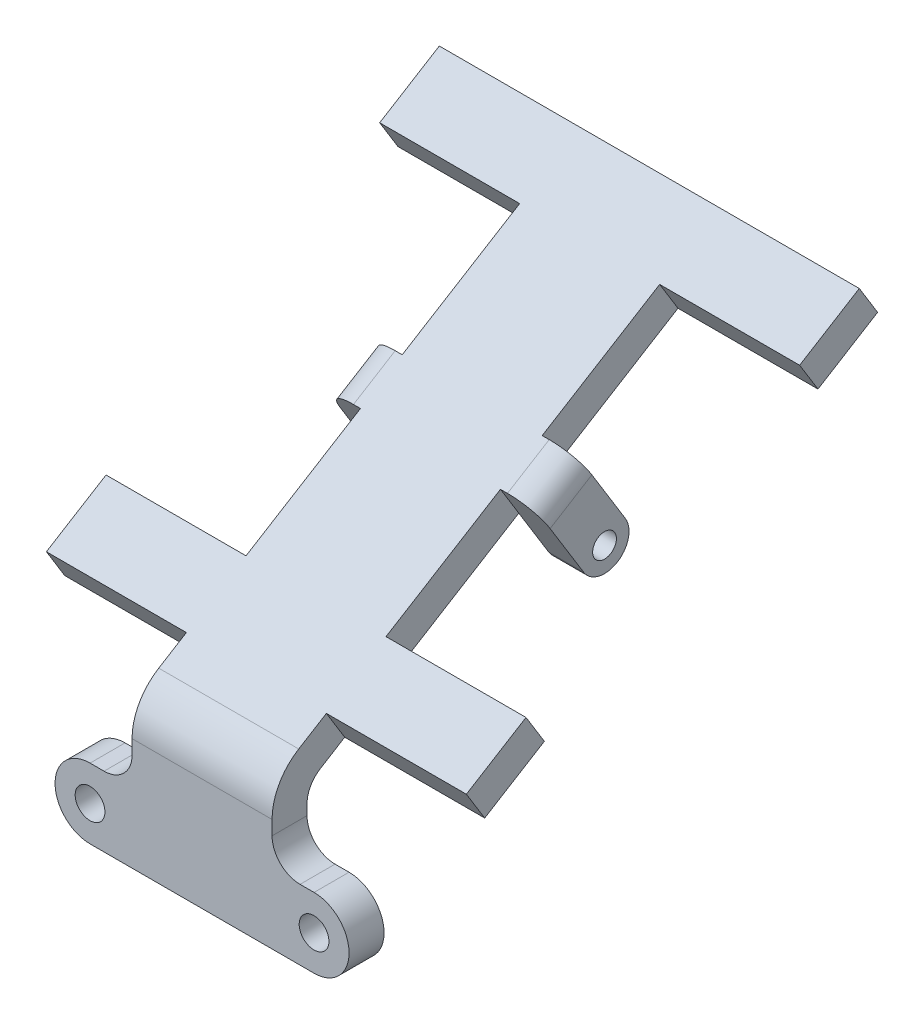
from build123d import *

# Parameters (mm, degrees)
ESQUISSE1_R          = 4.25
BASE_EXTRUSION_DEPTH = 10
BOSS_EXTRU_1_DEPTH   = 20
CONG_1_R             = 8
CONG_2_R             = 16
ESQUISSE3_R          = 3.4
BOSS_EXTRU_2_DEPTH   = 10
CONG_4_R             = 8
ESQUISSE4_W          = 120
ESQUISSE4_H          = 20
BOSS_EXTRU_3_DEPTH   = 10


with BuildPart() as part:
    # Esquisse1 → Base-Extrusion (new body)
    # profile 1 of 3: a face of its own
    with BuildSketch(Plane.XY):
        with BuildLine():
            Line((-20, 99.624166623), (-20, 86.624166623))
            ThreePointArc((-20, 86.624166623), (-22.343145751, 80.967312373), (-28, 78.624166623))
            Line((-28, 78.624166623), (-26.5, 78.624166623))
            Line((-26.5, 78.624166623), (-26.5, 58.624166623))
            Line((-26.5, 58.624166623), (26.5, 58.624166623))
            Line((26.5, 58.624166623), (26.5, 78.624166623))
            Line((26.5, 78.624166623), (28, 78.624166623))
            ThreePointArc((28, 78.624166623), (22.343145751, 80.967312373), (20, 86.624166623))
            Line((20, 86.624166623), (20, 99.624166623))
            Line((20, 99.624166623), (-20, 99.624166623))
        make_face()
    # profile 2 of 3: a face of its own
    with BuildSketch(Plane.XY):
        with BuildLine():
            Line((-26.5, 78.624166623), (-28, 78.624166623))
            Line((-28, 78.624166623), (-32, 78.624166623))
            ThreePointArc((-32, 78.624166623), (-42, 68.624166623), (-32, 58.624166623))
            Line((-32, 58.624166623), (-26.5, 58.624166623))
            Line((-26.5, 58.624166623), (-26.5, 78.624166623))
        make_face()
        with Locations((-32, 68.624166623)):
            Circle(ESQUISSE1_R, mode=Mode.SUBTRACT)
    # profile 3 of 3: a face of its own
    with BuildSketch(Plane.XY):
        with BuildLine():
            Line((32, 78.624166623), (28, 78.624166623))
            Line((28, 78.624166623), (26.5, 78.624166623))
            Line((26.5, 78.624166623), (26.5, 58.624166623))
            Line((26.5, 58.624166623), (32, 58.624166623))
            ThreePointArc((32, 58.624166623), (42, 68.624166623), (32, 78.624166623))
        make_face()
        with Locations((32, 68.624166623)):
            Circle(ESQUISSE1_R, mode=Mode.SUBTRACT)
    extrude(amount=BASE_EXTRUSION_DEPTH)

    # Esquisse2 → Boss.-Extru.1 (add, symmetric)
    with BuildSketch(Plane(origin=(0, 0, 0), x_dir=(0, 0, -1), z_dir=(1, 0, 0))):
        Polygon((-4.763290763, 91.1049603), (123.024804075, 169.655598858), (117.788094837, 178.17480518), (-10, 99.624166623), align=None)
    extrude(amount=BOSS_EXTRU_1_DEPTH, both=True)

    # Cong_1
    cong_1_edges = [part.edges().sort_by_distance(p)[0] for p in [
        (0, 94.032928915, 0),
    ]]
    fillet(cong_1_edges, radius=CONG_1_R)

    # Cong_2
    cong_2_edges = [part.edges().sort_by_distance(p)[0] for p in [
        (0, 99.624166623, 10),
    ]]
    fillet(cong_2_edges, radius=CONG_2_R)

    # Esquisse3 → Boss.-Extru.2 (add)
    with BuildSketch(Plane(origin=(-20, 10.478998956, -73.547266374), x_dir=(0, 0, 1), z_dir=(-1, 0, 0))):
        with BuildLine():
            Line((4.510710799, 106.855304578), (18.284049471, 129.262107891))
            Line((18.284049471, 129.262107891), (6.357160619, 136.593500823))
            Line((6.357160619, 136.593500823), (-7.416178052, 114.18669751))
            ThreePointArc((-7.416178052, 114.18669751), (-5.118430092, 104.557556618), (4.510710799, 106.855304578))
        make_face()
        with Locations(Location((-1.452733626, 110.521001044, 0), (0, 0, 270))):
            Circle(ESQUISSE3_R, mode=Mode.SUBTRACT)
    boss_extru_2 = extrude(amount=BOSS_EXTRU_2_DEPTH)

    # Sym_trie1: Boss.-Extru.2 across plane
    add(boss_extru_2.mirror(Plane(origin=(0, 0, 0), x_dir=(0, 0, 1), z_dir=(1, 0, 0))))

    # Cong_4
    cong_4_edges = [part.edges().sort_by_distance(p)[0] for p in [
        (-30, 143.406803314, -61.226661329),
        (30, 143.406803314, -61.226661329),
    ]]
    fillet(cong_4_edges, radius=CONG_4_R)

    # Esquisse4 → Boss.-Extru.3 (add)
    with BuildSketch(Plane(origin=(0, 76.765368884, 47.18724974), x_dir=(-1, 0, 0), z_dir=(0, 0.8519206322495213, 0.5236709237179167))):
        with Locations((0, -71.871750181)):
            Rectangle(ESQUISSE4_W, ESQUISSE4_H)
        with Locations((0, -183.651073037)):
            Rectangle(ESQUISSE4_W, ESQUISSE4_H)
    extrude(amount=-BOSS_EXTRU_3_DEPTH)


solid = part.part
